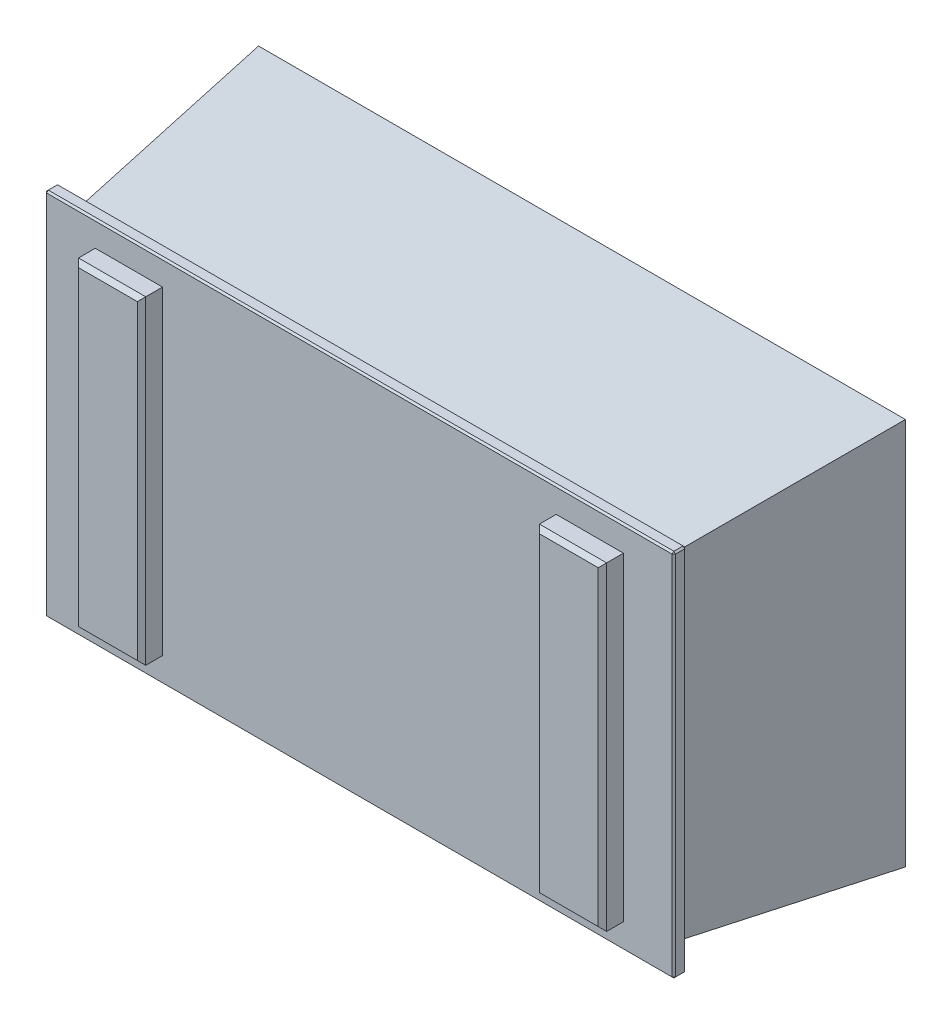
ISO-10303-21;
HEADER;
FILE_DESCRIPTION(('STEP AP214'),'2;1');
FILE_NAME('part.step','',(''),(''),'','','');
FILE_SCHEMA(('AUTOMOTIVE_DESIGN { 1 0 10303 214 1 1 1 1 }'));
ENDSEC;
DATA;
#1=APPLICATION_CONTEXT('core data for automotive mechanical design processes');
#2=APPLICATION_PROTOCOL_DEFINITION('international standard','automotive_design',2000,#1);
#3=PRODUCT_CONTEXT('',#1,'mechanical');
#4=PRODUCT('Part','Part','',(#3));
#5=PRODUCT_RELATED_PRODUCT_CATEGORY('part','',(#4));
#6=PRODUCT_DEFINITION_FORMATION('','',#4);
#7=PRODUCT_DEFINITION_CONTEXT('part definition',#1,'design');
#8=PRODUCT_DEFINITION('design','',#6,#7);
#9=PRODUCT_DEFINITION_SHAPE('','',#8);
#10=(LENGTH_UNIT() NAMED_UNIT(*) SI_UNIT(.MILLI.,.METRE.));
#11=(NAMED_UNIT(*) PLANE_ANGLE_UNIT() SI_UNIT($,.RADIAN.));
#12=(NAMED_UNIT(*) SI_UNIT($,.STERADIAN.) SOLID_ANGLE_UNIT());
#13=UNCERTAINTY_MEASURE_WITH_UNIT(LENGTH_MEASURE(1.E-05),#10,'distance_accuracy_value','');
#14=(GEOMETRIC_REPRESENTATION_CONTEXT(3) GLOBAL_UNCERTAINTY_ASSIGNED_CONTEXT((#13)) GLOBAL_UNIT_ASSIGNED_CONTEXT((#10,
#11,#12)) REPRESENTATION_CONTEXT('',''));
#15=CARTESIAN_POINT('',(0.,0.,0.));
#16=DIRECTION('',(0.,0.,1.));
#17=DIRECTION('',(1.,0.,0.));
#18=AXIS2_PLACEMENT_3D('',#15,#16,#17);
#19=CARTESIAN_POINT('',(-501.217589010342,-220.,-29.9001757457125));
#20=DIRECTION('',(0.,0.,1.));
#21=DIRECTION('',(1.,0.,0.));
#22=AXIS2_PLACEMENT_3D('',#19,#20,#21);
#23=PLANE('',#22);
#24=DIRECTION('',(0.,-1.,0.));
#25=VECTOR('',#24,1.);
#26=CARTESIAN_POINT('',(-499.217589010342,-220.,-29.9001757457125));
#27=LINE('',#26,#25);
#28=CARTESIAN_POINT('',(-499.217589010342,218.,-29.9001757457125));
#29=VERTEX_POINT('',#28);
#30=CARTESIAN_POINT('',(-499.217589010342,-218.,-29.9001757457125));
#31=VERTEX_POINT('',#30);
#32=EDGE_CURVE('E417',#29,#31,#27,.T.);
#33=ORIENTED_EDGE('',*,*,#32,.T.);
#34=DIRECTION('',(1.,0.,0.));
#35=VECTOR('',#34,1.);
#36=CARTESIAN_POINT('',(247.518820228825,-218.,-29.9001757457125));
#37=LINE('',#36,#35);
#38=CARTESIAN_POINT('',(245.518820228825,-218.,-29.9001757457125));
#39=VERTEX_POINT('',#38);
#40=EDGE_CURVE('E422',#31,#39,#37,.T.);
#41=ORIENTED_EDGE('',*,*,#40,.T.);
#42=DIRECTION('',(0.,1.,0.));
#43=VECTOR('',#42,1.);
#44=CARTESIAN_POINT('',(245.518820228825,220.,-29.9001757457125));
#45=LINE('',#44,#43);
#46=CARTESIAN_POINT('',(245.518820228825,218.,-29.9001757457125));
#47=VERTEX_POINT('',#46);
#48=EDGE_CURVE('E419',#39,#47,#45,.T.);
#49=ORIENTED_EDGE('',*,*,#48,.T.);
#50=DIRECTION('',(-1.,0.,0.));
#51=VECTOR('',#50,1.);
#52=CARTESIAN_POINT('',(-501.217589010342,218.,-29.9001757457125));
#53=LINE('',#52,#51);
#54=EDGE_CURVE('E396',#47,#29,#53,.T.);
#55=ORIENTED_EDGE('',*,*,#54,.T.);
#56=EDGE_LOOP('',(#33,#41,#49,#55));
#57=FACE_BOUND('',#56,.T.);
#58=DIRECTION('',(-1.,0.,0.));
#59=VECTOR('',#58,1.);
#60=CARTESIAN_POINT('',(187.518820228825,190.,-29.9001757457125));
#61=LINE('',#60,#59);
#62=CARTESIAN_POINT('',(187.518820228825,190.,-29.9001757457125));
#63=VERTEX_POINT('',#62);
#64=CARTESIAN_POINT('',(107.518820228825,190.,-29.9001757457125));
#65=VERTEX_POINT('',#64);
#66=EDGE_CURVE('E279',#63,#65,#61,.T.);
#67=ORIENTED_EDGE('',*,*,#66,.F.);
#68=DIRECTION('',(0.,1.,0.));
#69=VECTOR('',#68,1.);
#70=CARTESIAN_POINT('',(187.518820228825,-190.,-29.9001757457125));
#71=LINE('',#70,#69);
#72=CARTESIAN_POINT('',(187.518820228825,-190.,-29.9001757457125));
#73=VERTEX_POINT('',#72);
#74=EDGE_CURVE('E253',#73,#63,#71,.T.);
#75=ORIENTED_EDGE('',*,*,#74,.F.);
#76=DIRECTION('',(1.,0.,0.));
#77=VECTOR('',#76,1.);
#78=CARTESIAN_POINT('',(187.518820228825,-190.,-29.9001757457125));
#79=LINE('',#78,#77);
#80=CARTESIAN_POINT('',(107.518820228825,-190.,-29.9001757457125));
#81=VERTEX_POINT('',#80);
#82=EDGE_CURVE('E285',#81,#73,#79,.T.);
#83=ORIENTED_EDGE('',*,*,#82,.F.);
#84=DIRECTION('',(0.,-1.,0.));
#85=VECTOR('',#84,1.);
#86=CARTESIAN_POINT('',(107.518820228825,-190.,-29.9001757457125));
#87=LINE('',#86,#85);
#88=EDGE_CURVE('E282',#65,#81,#87,.T.);
#89=ORIENTED_EDGE('',*,*,#88,.F.);
#90=EDGE_LOOP('',(#67,#75,#83,#89));
#91=FACE_BOUND('',#90,.T.);
#92=DIRECTION('',(-1.,0.,0.));
#93=VECTOR('',#92,1.);
#94=CARTESIAN_POINT('',(-361.217589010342,190.,-29.9001757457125));
#95=LINE('',#94,#93);
#96=CARTESIAN_POINT('',(-361.217589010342,190.,-29.9001757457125));
#97=VERTEX_POINT('',#96);
#98=CARTESIAN_POINT('',(-441.217589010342,190.,-29.9001757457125));
#99=VERTEX_POINT('',#98);
#100=EDGE_CURVE('E247',#97,#99,#95,.T.);
#101=ORIENTED_EDGE('',*,*,#100,.F.);
#102=DIRECTION('',(0.,1.,0.));
#103=VECTOR('',#102,1.);
#104=CARTESIAN_POINT('',(-361.217589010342,-190.,-29.9001757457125));
#105=LINE('',#104,#103);
#106=CARTESIAN_POINT('',(-361.217589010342,-190.,-29.9001757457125));
#107=VERTEX_POINT('',#106);
#108=EDGE_CURVE('E257',#107,#97,#105,.T.);
#109=ORIENTED_EDGE('',*,*,#108,.F.);
#110=DIRECTION('',(1.,0.,0.));
#111=VECTOR('',#110,1.);
#112=CARTESIAN_POINT('',(-361.217589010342,-190.,-29.9001757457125));
#113=LINE('',#112,#111);
#114=CARTESIAN_POINT('',(-441.217589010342,-190.,-29.9001757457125));
#115=VERTEX_POINT('',#114);
#116=EDGE_CURVE('E269',#115,#107,#113,.T.);
#117=ORIENTED_EDGE('',*,*,#116,.F.);
#118=DIRECTION('',(0.,-1.,0.));
#119=VECTOR('',#118,1.);
#120=CARTESIAN_POINT('',(-441.217589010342,-190.,-29.9001757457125));
#121=LINE('',#120,#119);
#122=EDGE_CURVE('E267',#99,#115,#121,.T.);
#123=ORIENTED_EDGE('',*,*,#122,.F.);
#124=EDGE_LOOP('',(#101,#109,#117,#123));
#125=FACE_BOUND('',#124,.T.);
#126=ADVANCED_FACE('F33',(#57,#91,#125),#23,.T.);
#127=CARTESIAN_POINT('',(-481.217589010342,-200.,-294.900175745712));
#128=DIRECTION('',(0.,0.,-1.));
#129=DIRECTION('',(-1.,0.,0.));
#130=AXIS2_PLACEMENT_3D('',#127,#128,#129);
#131=PLANE('',#130);
#132=DIRECTION('',(1.,0.,0.));
#133=VECTOR('',#132,1.);
#134=CARTESIAN_POINT('',(227.518820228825,-230.696140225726,-294.900175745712));
#135=LINE('',#134,#133);
#136=CARTESIAN_POINT('',(258.214960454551,-230.696140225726,-294.900175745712));
#137=VERTEX_POINT('',#136);
#138=CARTESIAN_POINT('',(-511.913729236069,-230.696140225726,-294.900175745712));
#139=VERTEX_POINT('',#138);
#140=EDGE_CURVE('E340',#137,#139,#135,.F.);
#141=ORIENTED_EDGE('',*,*,#140,.T.);
#142=DIRECTION('',(0.,-1.,0.));
#143=VECTOR('',#142,1.);
#144=CARTESIAN_POINT('',(-511.913729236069,-200.,-294.900175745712));
#145=LINE('',#144,#143);
#146=CARTESIAN_POINT('',(-511.913729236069,230.696140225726,-294.900175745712));
#147=VERTEX_POINT('',#146);
#148=EDGE_CURVE('E357',#139,#147,#145,.F.);
#149=ORIENTED_EDGE('',*,*,#148,.T.);
#150=DIRECTION('',(-1.,0.,0.));
#151=VECTOR('',#150,1.);
#152=CARTESIAN_POINT('',(-481.217589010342,230.696140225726,-294.900175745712));
#153=LINE('',#152,#151);
#154=CARTESIAN_POINT('',(258.214960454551,230.696140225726,-294.900175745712));
#155=VERTEX_POINT('',#154);
#156=EDGE_CURVE('E359',#147,#155,#153,.F.);
#157=ORIENTED_EDGE('',*,*,#156,.T.);
#158=DIRECTION('',(0.,1.,0.));
#159=VECTOR('',#158,1.);
#160=CARTESIAN_POINT('',(258.214960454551,200.,-294.900175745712));
#161=LINE('',#160,#159);
#162=EDGE_CURVE('E350',#155,#137,#161,.F.);
#163=ORIENTED_EDGE('',*,*,#162,.T.);
#164=EDGE_LOOP('',(#141,#149,#157,#163));
#165=FACE_BOUND('',#164,.T.);
#166=DIRECTION('',(-1.,0.,0.));
#167=VECTOR('',#166,1.);
#168=CARTESIAN_POINT('',(-461.217589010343,210.696140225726,-294.900175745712));
#169=LINE('',#168,#167);
#170=CARTESIAN_POINT('',(-491.913729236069,210.696140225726,-294.900175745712));
#171=VERTEX_POINT('',#170);
#172=CARTESIAN_POINT('',(238.21496045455,210.696140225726,-294.900175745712));
#173=VERTEX_POINT('',#172);
#174=EDGE_CURVE('E300',#171,#173,#169,.F.);
#175=ORIENTED_EDGE('',*,*,#174,.F.);
#176=DIRECTION('',(0.,-1.,0.));
#177=VECTOR('',#176,1.);
#178=CARTESIAN_POINT('',(-491.913729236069,-180.,-294.900175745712));
#179=LINE('',#178,#177);
#180=CARTESIAN_POINT('',(-491.913729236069,-210.696140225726,-294.900175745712));
#181=VERTEX_POINT('',#180);
#182=EDGE_CURVE('E303',#181,#171,#179,.F.);
#183=ORIENTED_EDGE('',*,*,#182,.F.);
#184=DIRECTION('',(1.,0.,0.));
#185=VECTOR('',#184,1.);
#186=CARTESIAN_POINT('',(207.518820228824,-210.696140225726,-294.900175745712));
#187=LINE('',#186,#185);
#188=CARTESIAN_POINT('',(238.21496045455,-210.696140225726,-294.900175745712));
#189=VERTEX_POINT('',#188);
#190=EDGE_CURVE('E306',#189,#181,#187,.F.);
#191=ORIENTED_EDGE('',*,*,#190,.F.);
#192=DIRECTION('',(0.,1.,0.));
#193=VECTOR('',#192,1.);
#194=CARTESIAN_POINT('',(238.21496045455,180.,-294.900175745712));
#195=LINE('',#194,#193);
#196=EDGE_CURVE('E297',#173,#189,#195,.F.);
#197=ORIENTED_EDGE('',*,*,#196,.F.);
#198=EDGE_LOOP('',(#175,#183,#191,#197));
#199=FACE_BOUND('',#198,.T.);
#200=ADVANCED_FACE('F622',(#165,#199),#131,.T.);
#201=CARTESIAN_POINT('',(-501.217589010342,-220.,-44.9001757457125));
#202=DIRECTION('',(0.,0.,1.));
#203=DIRECTION('',(1.,0.,0.));
#204=AXIS2_PLACEMENT_3D('',#201,#202,#203);
#205=PLANE('',#204);
#206=DIRECTION('',(1.,0.,0.));
#207=VECTOR('',#206,1.);
#208=CARTESIAN_POINT('',(-501.217589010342,218.,-44.9001757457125));
#209=LINE('',#208,#207);
#210=CARTESIAN_POINT('',(-499.217589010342,218.,-44.9001757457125));
#211=VERTEX_POINT('',#210);
#212=CARTESIAN_POINT('',(245.518820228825,218.,-44.9001757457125));
#213=VERTEX_POINT('',#212);
#214=EDGE_CURVE('E433',#211,#213,#209,.T.);
#215=ORIENTED_EDGE('',*,*,#214,.T.);
#216=DIRECTION('',(0.,-1.,0.));
#217=VECTOR('',#216,1.);
#218=CARTESIAN_POINT('',(245.518820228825,-220.,-44.9001757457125));
#219=LINE('',#218,#217);
#220=CARTESIAN_POINT('',(245.518820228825,-218.,-44.9001757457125));
#221=VERTEX_POINT('',#220);
#222=EDGE_CURVE('E439',#213,#221,#219,.T.);
#223=ORIENTED_EDGE('',*,*,#222,.T.);
#224=DIRECTION('',(-1.,0.,0.));
#225=VECTOR('',#224,1.);
#226=CARTESIAN_POINT('',(-501.217589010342,-218.,-44.9001757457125));
#227=LINE('',#226,#225);
#228=CARTESIAN_POINT('',(-499.217589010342,-218.,-44.9001757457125));
#229=VERTEX_POINT('',#228);
#230=EDGE_CURVE('E437',#221,#229,#227,.T.);
#231=ORIENTED_EDGE('',*,*,#230,.T.);
#232=DIRECTION('',(0.,1.,0.));
#233=VECTOR('',#232,1.);
#234=CARTESIAN_POINT('',(-499.217589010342,-220.,-44.9001757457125));
#235=LINE('',#234,#233);
#236=EDGE_CURVE('E435',#229,#211,#235,.T.);
#237=ORIENTED_EDGE('',*,*,#236,.T.);
#238=EDGE_LOOP('',(#215,#223,#231,#237));
#239=FACE_BOUND('',#238,.T.);
#240=DIRECTION('',(-1.,0.,0.));
#241=VECTOR('',#240,1.);
#242=CARTESIAN_POINT('',(227.518820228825,-200.,-44.9001757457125));
#243=LINE('',#242,#241);
#244=CARTESIAN_POINT('',(227.518820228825,-200.,-44.9001757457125));
#245=VERTEX_POINT('',#244);
#246=CARTESIAN_POINT('',(-481.217589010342,-200.,-44.9001757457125));
#247=VERTEX_POINT('',#246);
#248=EDGE_CURVE('E328',#245,#247,#243,.T.);
#249=ORIENTED_EDGE('',*,*,#248,.F.);
#250=DIRECTION('',(0.,-1.,0.));
#251=VECTOR('',#250,1.);
#252=CARTESIAN_POINT('',(227.518820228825,200.,-44.9001757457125));
#253=LINE('',#252,#251);
#254=CARTESIAN_POINT('',(227.518820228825,200.,-44.9001757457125));
#255=VERTEX_POINT('',#254);
#256=EDGE_CURVE('E337',#255,#245,#253,.T.);
#257=ORIENTED_EDGE('',*,*,#256,.F.);
#258=DIRECTION('',(1.,0.,0.));
#259=VECTOR('',#258,1.);
#260=CARTESIAN_POINT('',(-481.217589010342,200.,-44.9001757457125));
#261=LINE('',#260,#259);
#262=CARTESIAN_POINT('',(-481.217589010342,200.,-44.9001757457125));
#263=VERTEX_POINT('',#262);
#264=EDGE_CURVE('E334',#263,#255,#261,.T.);
#265=ORIENTED_EDGE('',*,*,#264,.F.);
#266=DIRECTION('',(0.,1.,0.));
#267=VECTOR('',#266,1.);
#268=CARTESIAN_POINT('',(-481.217589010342,-200.,-44.9001757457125));
#269=LINE('',#268,#267);
#270=EDGE_CURVE('E331',#247,#263,#269,.T.);
#271=ORIENTED_EDGE('',*,*,#270,.F.);
#272=EDGE_LOOP('',(#249,#257,#265,#271));
#273=FACE_BOUND('',#272,.T.);
#274=ADVANCED_FACE('F583',(#239,#273),#205,.F.);
#275=CARTESIAN_POINT('',(-501.217589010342,220.,-29.9001757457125));
#276=DIRECTION('',(1.,0.,0.));
#277=DIRECTION('',(0.,0.,-1.));
#278=AXIS2_PLACEMENT_3D('',#275,#276,#277);
#279=PLANE('',#278);
#280=DIRECTION('',(0.,0.,1.));
#281=VECTOR('',#280,1.);
#282=CARTESIAN_POINT('',(-501.217589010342,-218.,-29.9001757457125));
#283=LINE('',#282,#281);
#284=CARTESIAN_POINT('',(-501.217589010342,-218.,-42.9001757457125));
#285=VERTEX_POINT('',#284);
#286=CARTESIAN_POINT('',(-501.217589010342,-218.,-31.9001757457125));
#287=VERTEX_POINT('',#286);
#288=EDGE_CURVE('E446',#285,#287,#283,.T.);
#289=ORIENTED_EDGE('',*,*,#288,.T.);
#290=DIRECTION('',(0.,1.,0.));
#291=VECTOR('',#290,1.);
#292=CARTESIAN_POINT('',(-501.217589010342,220.,-31.9001757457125));
#293=LINE('',#292,#291);
#294=CARTESIAN_POINT('',(-501.217589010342,218.,-31.9001757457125));
#295=VERTEX_POINT('',#294);
#296=EDGE_CURVE('E448',#287,#295,#293,.T.);
#297=ORIENTED_EDGE('',*,*,#296,.T.);
#298=DIRECTION('',(0.,0.,-1.));
#299=VECTOR('',#298,1.);
#300=CARTESIAN_POINT('',(-501.217589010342,218.,-29.9001757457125));
#301=LINE('',#300,#299);
#302=CARTESIAN_POINT('',(-501.217589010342,218.,-42.9001757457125));
#303=VERTEX_POINT('',#302);
#304=EDGE_CURVE('E442',#295,#303,#301,.T.);
#305=ORIENTED_EDGE('',*,*,#304,.T.);
#306=DIRECTION('',(0.,-1.,0.));
#307=VECTOR('',#306,1.);
#308=CARTESIAN_POINT('',(-501.217589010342,220.,-42.9001757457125));
#309=LINE('',#308,#307);
#310=EDGE_CURVE('E444',#303,#285,#309,.T.);
#311=ORIENTED_EDGE('',*,*,#310,.T.);
#312=EDGE_LOOP('',(#289,#297,#305,#311));
#313=FACE_BOUND('',#312,.T.);
#314=ADVANCED_FACE('F574',(#313),#279,.F.);
#315=CARTESIAN_POINT('',(-501.217589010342,-220.,-29.9001757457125));
#316=DIRECTION('',(0.,1.,0.));
#317=DIRECTION('',(0.,0.,1.));
#318=AXIS2_PLACEMENT_3D('',#315,#316,#317);
#319=PLANE('',#318);
#320=DIRECTION('',(-1.,0.,0.));
#321=VECTOR('',#320,1.);
#322=CARTESIAN_POINT('',(-501.217589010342,-220.,-31.9001757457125));
#323=LINE('',#322,#321);
#324=CARTESIAN_POINT('',(245.518820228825,-220.,-31.9001757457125));
#325=VERTEX_POINT('',#324);
#326=CARTESIAN_POINT('',(-499.217589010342,-220.,-31.9001757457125));
#327=VERTEX_POINT('',#326);
#328=EDGE_CURVE('E455',#325,#327,#323,.T.);
#329=ORIENTED_EDGE('',*,*,#328,.T.);
#330=DIRECTION('',(0.,0.,-1.));
#331=VECTOR('',#330,1.);
#332=CARTESIAN_POINT('',(-499.217589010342,-220.,-29.9001757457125));
#333=LINE('',#332,#331);
#334=CARTESIAN_POINT('',(-499.217589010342,-220.,-42.9001757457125));
#335=VERTEX_POINT('',#334);
#336=EDGE_CURVE('E457',#327,#335,#333,.T.);
#337=ORIENTED_EDGE('',*,*,#336,.T.);
#338=DIRECTION('',(1.,0.,0.));
#339=VECTOR('',#338,1.);
#340=CARTESIAN_POINT('',(-501.217589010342,-220.,-42.9001757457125));
#341=LINE('',#340,#339);
#342=CARTESIAN_POINT('',(245.518820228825,-220.,-42.9001757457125));
#343=VERTEX_POINT('',#342);
#344=EDGE_CURVE('E451',#335,#343,#341,.T.);
#345=ORIENTED_EDGE('',*,*,#344,.T.);
#346=DIRECTION('',(0.,0.,1.));
#347=VECTOR('',#346,1.);
#348=CARTESIAN_POINT('',(245.518820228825,-220.,-29.9001757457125));
#349=LINE('',#348,#347);
#350=EDGE_CURVE('E453',#343,#325,#349,.T.);
#351=ORIENTED_EDGE('',*,*,#350,.T.);
#352=EDGE_LOOP('',(#329,#337,#345,#351));
#353=FACE_BOUND('',#352,.T.);
#354=ADVANCED_FACE('F546',(#353),#319,.F.);
#355=CARTESIAN_POINT('',(247.518820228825,220.,-29.9001757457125));
#356=DIRECTION('',(-1.,0.,0.));
#357=DIRECTION('',(0.,-1.,0.));
#358=AXIS2_PLACEMENT_3D('',#355,#356,#357);
#359=PLANE('',#358);
#360=DIRECTION('',(0.,-1.,0.));
#361=VECTOR('',#360,1.);
#362=CARTESIAN_POINT('',(247.518820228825,-220.,-31.9001757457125));
#363=LINE('',#362,#361);
#364=CARTESIAN_POINT('',(247.518820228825,218.,-31.9001757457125));
#365=VERTEX_POINT('',#364);
#366=CARTESIAN_POINT('',(247.518820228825,-218.,-31.9001757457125));
#367=VERTEX_POINT('',#366);
#368=EDGE_CURVE('E428',#365,#367,#363,.T.);
#369=ORIENTED_EDGE('',*,*,#368,.T.);
#370=DIRECTION('',(0.,0.,-1.));
#371=VECTOR('',#370,1.);
#372=CARTESIAN_POINT('',(247.518820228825,-218.,-29.9001757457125));
#373=LINE('',#372,#371);
#374=CARTESIAN_POINT('',(247.518820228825,-218.,-42.9001757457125));
#375=VERTEX_POINT('',#374);
#376=EDGE_CURVE('E431',#367,#375,#373,.T.);
#377=ORIENTED_EDGE('',*,*,#376,.T.);
#378=DIRECTION('',(0.,1.,0.));
#379=VECTOR('',#378,1.);
#380=CARTESIAN_POINT('',(247.518820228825,220.,-42.9001757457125));
#381=LINE('',#380,#379);
#382=CARTESIAN_POINT('',(247.518820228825,218.,-42.9001757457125));
#383=VERTEX_POINT('',#382);
#384=EDGE_CURVE('E426',#375,#383,#381,.T.);
#385=ORIENTED_EDGE('',*,*,#384,.T.);
#386=DIRECTION('',(0.,0.,1.));
#387=VECTOR('',#386,1.);
#388=CARTESIAN_POINT('',(247.518820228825,218.,-29.9001757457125));
#389=LINE('',#388,#387);
#390=EDGE_CURVE('E424',#383,#365,#389,.T.);
#391=ORIENTED_EDGE('',*,*,#390,.T.);
#392=EDGE_LOOP('',(#369,#377,#385,#391));
#393=FACE_BOUND('',#392,.T.);
#394=ADVANCED_FACE('F643',(#393),#359,.F.);
#395=CARTESIAN_POINT('',(-501.217589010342,220.,-29.9001757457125));
#396=DIRECTION('',(0.,-1.,0.));
#397=DIRECTION('',(0.,0.,-1.));
#398=AXIS2_PLACEMENT_3D('',#395,#396,#397);
#399=PLANE('',#398);
#400=DIRECTION('',(1.,0.,0.));
#401=VECTOR('',#400,1.);
#402=CARTESIAN_POINT('',(247.518820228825,220.,-31.9001757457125));
#403=LINE('',#402,#401);
#404=CARTESIAN_POINT('',(-499.217589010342,220.,-31.9001757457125));
#405=VERTEX_POINT('',#404);
#406=CARTESIAN_POINT('',(245.518820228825,220.,-31.9001757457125));
#407=VERTEX_POINT('',#406);
#408=EDGE_CURVE('E42',#405,#407,#403,.T.);
#409=ORIENTED_EDGE('',*,*,#408,.T.);
#410=DIRECTION('',(0.,0.,-1.));
#411=VECTOR('',#410,1.);
#412=CARTESIAN_POINT('',(245.518820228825,220.,-29.9001757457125));
#413=LINE('',#412,#411);
#414=CARTESIAN_POINT('',(245.518820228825,220.,-42.9001757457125));
#415=VERTEX_POINT('',#414);
#416=EDGE_CURVE('E11',#407,#415,#413,.T.);
#417=ORIENTED_EDGE('',*,*,#416,.T.);
#418=DIRECTION('',(-1.,0.,0.));
#419=VECTOR('',#418,1.);
#420=CARTESIAN_POINT('',(-501.217589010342,220.,-42.9001757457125));
#421=LINE('',#420,#419);
#422=CARTESIAN_POINT('',(-499.217589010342,220.,-42.9001757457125));
#423=VERTEX_POINT('',#422);
#424=EDGE_CURVE('E460',#415,#423,#421,.T.);
#425=ORIENTED_EDGE('',*,*,#424,.T.);
#426=DIRECTION('',(0.,0.,1.));
#427=VECTOR('',#426,1.);
#428=CARTESIAN_POINT('',(-499.217589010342,220.,-29.9001757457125));
#429=LINE('',#428,#427);
#430=EDGE_CURVE('E53',#423,#405,#429,.T.);
#431=ORIENTED_EDGE('',*,*,#430,.T.);
#432=EDGE_LOOP('',(#409,#417,#425,#431));
#433=FACE_BOUND('',#432,.T.);
#434=ADVANCED_FACE('F639',(#433),#399,.F.);
#435=CARTESIAN_POINT('',(227.518820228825,-200.,-44.9001757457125));
#436=DIRECTION('',(0.,-0.992546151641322,0.121869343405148));
#437=DIRECTION('',(0.,-0.121869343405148,-0.992546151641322));
#438=AXIS2_PLACEMENT_3D('',#435,#436,#437);
#439=PLANE('',#438);
#440=ORIENTED_EDGE('',*,*,#248,.T.);
#441=DIRECTION('',(0.120974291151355,0.120974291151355,0.985256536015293));
#442=VECTOR('',#441,1.);
#443=CARTESIAN_POINT('',(-481.217589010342,-200.,-44.9001757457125));
#444=LINE('',#443,#442);
#445=EDGE_CURVE('E341',#139,#247,#444,.T.);
#446=ORIENTED_EDGE('',*,*,#445,.F.);
#447=ORIENTED_EDGE('',*,*,#140,.F.);
#448=DIRECTION('',(-0.120974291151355,0.120974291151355,0.985256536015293));
#449=VECTOR('',#448,1.);
#450=CARTESIAN_POINT('',(227.518820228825,-200.,-44.9001757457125));
#451=LINE('',#450,#449);
#452=EDGE_CURVE('E346',#137,#245,#451,.T.);
#453=ORIENTED_EDGE('',*,*,#452,.T.);
#454=EDGE_LOOP('',(#440,#446,#447,#453));
#455=FACE_BOUND('',#454,.T.);
#456=ADVANCED_FACE('F642',(#455),#439,.T.);
#457=CARTESIAN_POINT('',(-481.217589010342,-200.,-44.9001757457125));
#458=DIRECTION('',(-0.992546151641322,0.,0.121869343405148));
#459=DIRECTION('',(0.121869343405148,0.,0.992546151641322));
#460=AXIS2_PLACEMENT_3D('',#457,#458,#459);
#461=PLANE('',#460);
#462=ORIENTED_EDGE('',*,*,#270,.T.);
#463=DIRECTION('',(0.120974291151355,-0.120974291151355,0.985256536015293));
#464=VECTOR('',#463,1.);
#465=CARTESIAN_POINT('',(-481.217589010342,200.,-44.9001757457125));
#466=LINE('',#465,#464);
#467=EDGE_CURVE('E345',#147,#263,#466,.T.);
#468=ORIENTED_EDGE('',*,*,#467,.F.);
#469=ORIENTED_EDGE('',*,*,#148,.F.);
#470=ORIENTED_EDGE('',*,*,#445,.T.);
#471=EDGE_LOOP('',(#462,#468,#469,#470));
#472=FACE_BOUND('',#471,.T.);
#473=ADVANCED_FACE('F631',(#472),#461,.T.);
#474=CARTESIAN_POINT('',(-481.217589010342,200.,-44.9001757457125));
#475=DIRECTION('',(0.,0.992546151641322,0.121869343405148));
#476=DIRECTION('',(0.,-0.121869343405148,0.992546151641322));
#477=AXIS2_PLACEMENT_3D('',#474,#475,#476);
#478=PLANE('',#477);
#479=ORIENTED_EDGE('',*,*,#264,.T.);
#480=DIRECTION('',(-0.120974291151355,-0.120974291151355,0.985256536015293));
#481=VECTOR('',#480,1.);
#482=CARTESIAN_POINT('',(227.518820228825,200.,-44.9001757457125));
#483=LINE('',#482,#481);
#484=EDGE_CURVE('E349',#155,#255,#483,.T.);
#485=ORIENTED_EDGE('',*,*,#484,.F.);
#486=ORIENTED_EDGE('',*,*,#156,.F.);
#487=ORIENTED_EDGE('',*,*,#467,.T.);
#488=EDGE_LOOP('',(#479,#485,#486,#487));
#489=FACE_BOUND('',#488,.T.);
#490=ADVANCED_FACE('F1011',(#489),#478,.T.);
#491=CARTESIAN_POINT('',(227.518820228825,200.,-44.9001757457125));
#492=DIRECTION('',(0.992546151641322,0.,0.121869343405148));
#493=DIRECTION('',(0.121869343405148,0.,-0.992546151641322));
#494=AXIS2_PLACEMENT_3D('',#491,#492,#493);
#495=PLANE('',#494);
#496=ORIENTED_EDGE('',*,*,#256,.T.);
#497=ORIENTED_EDGE('',*,*,#452,.F.);
#498=ORIENTED_EDGE('',*,*,#162,.F.);
#499=ORIENTED_EDGE('',*,*,#484,.T.);
#500=EDGE_LOOP('',(#496,#497,#498,#499));
#501=FACE_BOUND('',#500,.T.);
#502=ADVANCED_FACE('F997',(#501),#495,.T.);
#503=CARTESIAN_POINT('',(-461.217589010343,-180.,-44.9001757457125));
#504=DIRECTION('',(-0.992546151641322,0.,0.121869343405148));
#505=DIRECTION('',(0.121869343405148,0.,0.992546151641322));
#506=AXIS2_PLACEMENT_3D('',#503,#504,#505);
#507=PLANE('',#506);
#508=ORIENTED_EDGE('',*,*,#182,.T.);
#509=DIRECTION('',(0.120974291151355,-0.120974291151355,0.985256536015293));
#510=VECTOR('',#509,1.);
#511=CARTESIAN_POINT('',(-461.217589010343,180.,-44.9001757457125));
#512=LINE('',#511,#510);
#513=CARTESIAN_POINT('',(-461.217589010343,180.,-44.9001757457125));
#514=VERTEX_POINT('',#513);
#515=EDGE_CURVE('E310',#171,#514,#512,.T.);
#516=ORIENTED_EDGE('',*,*,#515,.T.);
#517=DIRECTION('',(0.,1.,0.));
#518=VECTOR('',#517,1.);
#519=CARTESIAN_POINT('',(-461.217589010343,-180.,-44.9001757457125));
#520=LINE('',#519,#518);
#521=CARTESIAN_POINT('',(-461.217589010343,-180.,-44.9001757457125));
#522=VERTEX_POINT('',#521);
#523=EDGE_CURVE('E319',#522,#514,#520,.T.);
#524=ORIENTED_EDGE('',*,*,#523,.F.);
#525=DIRECTION('',(0.120974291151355,0.120974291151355,0.985256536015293));
#526=VECTOR('',#525,1.);
#527=CARTESIAN_POINT('',(-461.217589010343,-180.,-44.9001757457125));
#528=LINE('',#527,#526);
#529=EDGE_CURVE('E296',#181,#522,#528,.T.);
#530=ORIENTED_EDGE('',*,*,#529,.F.);
#531=EDGE_LOOP('',(#508,#516,#524,#530));
#532=FACE_BOUND('',#531,.T.);
#533=ADVANCED_FACE('F987',(#532),#507,.F.);
#534=CARTESIAN_POINT('',(-461.217589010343,180.,-44.9001757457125));
#535=DIRECTION('',(0.,0.992546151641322,0.121869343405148));
#536=DIRECTION('',(0.,-0.121869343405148,0.992546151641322));
#537=AXIS2_PLACEMENT_3D('',#534,#535,#536);
#538=PLANE('',#537);
#539=ORIENTED_EDGE('',*,*,#174,.T.);
#540=DIRECTION('',(-0.120974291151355,-0.120974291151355,0.985256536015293));
#541=VECTOR('',#540,1.);
#542=CARTESIAN_POINT('',(207.518820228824,180.,-44.9001757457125));
#543=LINE('',#542,#541);
#544=CARTESIAN_POINT('',(207.518820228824,180.,-44.9001757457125));
#545=VERTEX_POINT('',#544);
#546=EDGE_CURVE('E312',#173,#545,#543,.T.);
#547=ORIENTED_EDGE('',*,*,#546,.T.);
#548=DIRECTION('',(1.,0.,0.));
#549=VECTOR('',#548,1.);
#550=CARTESIAN_POINT('',(-461.217589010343,180.,-44.9001757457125));
#551=LINE('',#550,#549);
#552=EDGE_CURVE('E322',#514,#545,#551,.T.);
#553=ORIENTED_EDGE('',*,*,#552,.F.);
#554=ORIENTED_EDGE('',*,*,#515,.F.);
#555=EDGE_LOOP('',(#539,#547,#553,#554));
#556=FACE_BOUND('',#555,.T.);
#557=ADVANCED_FACE('F978',(#556),#538,.F.);
#558=CARTESIAN_POINT('',(207.518820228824,180.,-44.9001757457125));
#559=DIRECTION('',(0.992546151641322,0.,0.121869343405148));
#560=DIRECTION('',(0.121869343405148,0.,-0.992546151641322));
#561=AXIS2_PLACEMENT_3D('',#558,#559,#560);
#562=PLANE('',#561);
#563=ORIENTED_EDGE('',*,*,#196,.T.);
#564=DIRECTION('',(-0.120974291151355,0.120974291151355,0.985256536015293));
#565=VECTOR('',#564,1.);
#566=CARTESIAN_POINT('',(207.518820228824,-180.,-44.9001757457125));
#567=LINE('',#566,#565);
#568=CARTESIAN_POINT('',(207.518820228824,-180.,-44.9001757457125));
#569=VERTEX_POINT('',#568);
#570=EDGE_CURVE('E309',#189,#569,#567,.T.);
#571=ORIENTED_EDGE('',*,*,#570,.T.);
#572=DIRECTION('',(0.,-1.,0.));
#573=VECTOR('',#572,1.);
#574=CARTESIAN_POINT('',(207.518820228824,180.,-44.9001757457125));
#575=LINE('',#574,#573);
#576=EDGE_CURVE('E325',#545,#569,#575,.T.);
#577=ORIENTED_EDGE('',*,*,#576,.F.);
#578=ORIENTED_EDGE('',*,*,#546,.F.);
#579=EDGE_LOOP('',(#563,#571,#577,#578));
#580=FACE_BOUND('',#579,.T.);
#581=ADVANCED_FACE('F969',(#580),#562,.F.);
#582=CARTESIAN_POINT('',(207.518820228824,-180.,-44.9001757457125));
#583=DIRECTION('',(0.,-0.992546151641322,0.121869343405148));
#584=DIRECTION('',(0.,-0.121869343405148,-0.992546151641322));
#585=AXIS2_PLACEMENT_3D('',#582,#583,#584);
#586=PLANE('',#585);
#587=ORIENTED_EDGE('',*,*,#190,.T.);
#588=ORIENTED_EDGE('',*,*,#529,.T.);
#589=DIRECTION('',(-1.,0.,0.));
#590=VECTOR('',#589,1.);
#591=CARTESIAN_POINT('',(207.518820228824,-180.,-44.9001757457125));
#592=LINE('',#591,#590);
#593=EDGE_CURVE('E299',#569,#522,#592,.T.);
#594=ORIENTED_EDGE('',*,*,#593,.F.);
#595=ORIENTED_EDGE('',*,*,#570,.F.);
#596=EDGE_LOOP('',(#587,#588,#594,#595));
#597=FACE_BOUND('',#596,.T.);
#598=ADVANCED_FACE('F637',(#597),#586,.F.);
#599=ORIENTED_EDGE('',*,*,#576,.T.);
#600=ORIENTED_EDGE('',*,*,#593,.T.);
#601=ORIENTED_EDGE('',*,*,#523,.T.);
#602=ORIENTED_EDGE('',*,*,#552,.T.);
#603=EDGE_LOOP('',(#599,#600,#601,#602));
#604=FACE_BOUND('',#603,.T.);
#605=ADVANCED_FACE('F633',(#604),#205,.F.);
#606=CARTESIAN_POINT('',(187.518820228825,-190.,-4.90017574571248));
#607=DIRECTION('',(-1.,0.,0.));
#608=DIRECTION('',(0.,0.,1.));
#609=AXIS2_PLACEMENT_3D('',#606,#607,#608);
#610=PLANE('',#609);
#611=DIRECTION('',(0.,0.,-1.));
#612=VECTOR('',#611,1.);
#613=CARTESIAN_POINT('',(187.518820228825,190.,-4.90017574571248));
#614=LINE('',#613,#612);
#615=CARTESIAN_POINT('',(187.518820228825,190.,-9.90017574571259));
#616=VERTEX_POINT('',#615);
#617=EDGE_CURVE('E294',#616,#63,#614,.T.);
#618=ORIENTED_EDGE('',*,*,#617,.F.);
#619=DIRECTION('',(0.,-1.,0.));
#620=VECTOR('',#619,1.);
#621=CARTESIAN_POINT('',(187.518820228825,-190.,-9.90017574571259));
#622=LINE('',#621,#620);
#623=CARTESIAN_POINT('',(187.518820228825,-190.,-9.90017574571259));
#624=VERTEX_POINT('',#623);
#625=EDGE_CURVE('E394',#616,#624,#622,.T.);
#626=ORIENTED_EDGE('',*,*,#625,.T.);
#627=DIRECTION('',(0.,0.,-1.));
#628=VECTOR('',#627,1.);
#629=CARTESIAN_POINT('',(187.518820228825,-190.,-4.90017574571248));
#630=LINE('',#629,#628);
#631=EDGE_CURVE('E288',#624,#73,#630,.T.);
#632=ORIENTED_EDGE('',*,*,#631,.T.);
#633=ORIENTED_EDGE('',*,*,#74,.T.);
#634=EDGE_LOOP('',(#618,#626,#632,#633));
#635=FACE_BOUND('',#634,.T.);
#636=ADVANCED_FACE('F636',(#635),#610,.F.);
#637=CARTESIAN_POINT('',(187.518820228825,190.,-4.90017574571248));
#638=DIRECTION('',(0.,-1.,0.));
#639=DIRECTION('',(0.,0.,-1.));
#640=AXIS2_PLACEMENT_3D('',#637,#638,#639);
#641=PLANE('',#640);
#642=DIRECTION('',(0.,0.,-1.));
#643=VECTOR('',#642,1.);
#644=CARTESIAN_POINT('',(107.518820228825,190.,-4.90017574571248));
#645=LINE('',#644,#643);
#646=CARTESIAN_POINT('',(107.518820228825,190.,-9.90017574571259));
#647=VERTEX_POINT('',#646);
#648=EDGE_CURVE('E292',#647,#65,#645,.T.);
#649=ORIENTED_EDGE('',*,*,#648,.F.);
#650=DIRECTION('',(1.,0.,0.));
#651=VECTOR('',#650,1.);
#652=CARTESIAN_POINT('',(187.518820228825,190.,-9.90017574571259));
#653=LINE('',#652,#651);
#654=EDGE_CURVE('E392',#647,#616,#653,.T.);
#655=ORIENTED_EDGE('',*,*,#654,.T.);
#656=ORIENTED_EDGE('',*,*,#617,.T.);
#657=ORIENTED_EDGE('',*,*,#66,.T.);
#658=EDGE_LOOP('',(#649,#655,#656,#657));
#659=FACE_BOUND('',#658,.T.);
#660=ADVANCED_FACE('F938',(#659),#641,.F.);
#661=CARTESIAN_POINT('',(107.518820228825,-190.,-4.90017574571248));
#662=DIRECTION('',(1.,0.,0.));
#663=DIRECTION('',(0.,0.,-1.));
#664=AXIS2_PLACEMENT_3D('',#661,#662,#663);
#665=PLANE('',#664);
#666=DIRECTION('',(0.,0.,-1.));
#667=VECTOR('',#666,1.);
#668=CARTESIAN_POINT('',(107.518820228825,-190.,-4.90017574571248));
#669=LINE('',#668,#667);
#670=CARTESIAN_POINT('',(107.518820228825,-190.,-9.90017574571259));
#671=VERTEX_POINT('',#670);
#672=EDGE_CURVE('E290',#671,#81,#669,.T.);
#673=ORIENTED_EDGE('',*,*,#672,.F.);
#674=DIRECTION('',(0.,1.,0.));
#675=VECTOR('',#674,1.);
#676=CARTESIAN_POINT('',(107.518820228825,190.,-9.90017574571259));
#677=LINE('',#676,#675);
#678=EDGE_CURVE('E390',#671,#647,#677,.T.);
#679=ORIENTED_EDGE('',*,*,#678,.T.);
#680=ORIENTED_EDGE('',*,*,#648,.T.);
#681=ORIENTED_EDGE('',*,*,#88,.T.);
#682=EDGE_LOOP('',(#673,#679,#680,#681));
#683=FACE_BOUND('',#682,.T.);
#684=ADVANCED_FACE('F929',(#683),#665,.F.);
#685=CARTESIAN_POINT('',(187.518820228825,-190.,-4.90017574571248));
#686=DIRECTION('',(0.,1.,0.));
#687=DIRECTION('',(0.,0.,1.));
#688=AXIS2_PLACEMENT_3D('',#685,#686,#687);
#689=PLANE('',#688);
#690=ORIENTED_EDGE('',*,*,#631,.F.);
#691=DIRECTION('',(-1.,0.,0.));
#692=VECTOR('',#691,1.);
#693=CARTESIAN_POINT('',(107.518820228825,-190.,-9.90017574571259));
#694=LINE('',#693,#692);
#695=EDGE_CURVE('E387',#624,#671,#694,.T.);
#696=ORIENTED_EDGE('',*,*,#695,.T.);
#697=ORIENTED_EDGE('',*,*,#672,.T.);
#698=ORIENTED_EDGE('',*,*,#82,.T.);
#699=EDGE_LOOP('',(#690,#696,#697,#698));
#700=FACE_BOUND('',#699,.T.);
#701=ADVANCED_FACE('F920',(#700),#689,.F.);
#702=CARTESIAN_POINT('',(187.518820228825,190.,-4.90017574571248));
#703=DIRECTION('',(0.,0.,1.));
#704=DIRECTION('',(1.,0.,0.));
#705=AXIS2_PLACEMENT_3D('',#702,#703,#704);
#706=PLANE('',#705);
#707=DIRECTION('',(0.,-1.,0.));
#708=VECTOR('',#707,1.);
#709=CARTESIAN_POINT('',(112.518820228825,-190.,-4.90017574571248));
#710=LINE('',#709,#708);
#711=CARTESIAN_POINT('',(112.518820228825,185.,-4.90017574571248));
#712=VERTEX_POINT('',#711);
#713=CARTESIAN_POINT('',(112.518820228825,-185.,-4.90017574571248));
#714=VERTEX_POINT('',#713);
#715=EDGE_CURVE('E382',#712,#714,#710,.T.);
#716=ORIENTED_EDGE('',*,*,#715,.T.);
#717=DIRECTION('',(1.,0.,0.));
#718=VECTOR('',#717,1.);
#719=CARTESIAN_POINT('',(187.518820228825,-185.,-4.90017574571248));
#720=LINE('',#719,#718);
#721=CARTESIAN_POINT('',(182.518820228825,-185.,-4.90017574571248));
#722=VERTEX_POINT('',#721);
#723=EDGE_CURVE('E384',#714,#722,#720,.T.);
#724=ORIENTED_EDGE('',*,*,#723,.T.);
#725=DIRECTION('',(0.,1.,0.));
#726=VECTOR('',#725,1.);
#727=CARTESIAN_POINT('',(182.518820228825,190.,-4.90017574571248));
#728=LINE('',#727,#726);
#729=CARTESIAN_POINT('',(182.518820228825,185.,-4.90017574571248));
#730=VERTEX_POINT('',#729);
#731=EDGE_CURVE('E378',#722,#730,#728,.T.);
#732=ORIENTED_EDGE('',*,*,#731,.T.);
#733=DIRECTION('',(-1.,0.,0.));
#734=VECTOR('',#733,1.);
#735=CARTESIAN_POINT('',(107.518820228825,185.,-4.90017574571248));
#736=LINE('',#735,#734);
#737=EDGE_CURVE('E380',#730,#712,#736,.T.);
#738=ORIENTED_EDGE('',*,*,#737,.T.);
#739=EDGE_LOOP('',(#716,#724,#732,#738));
#740=FACE_BOUND('',#739,.T.);
#741=ADVANCED_FACE('F912',(#740),#706,.T.);
#742=CARTESIAN_POINT('',(-361.217589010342,-190.,-4.90017574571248));
#743=DIRECTION('',(-1.,0.,0.));
#744=DIRECTION('',(0.,0.,1.));
#745=AXIS2_PLACEMENT_3D('',#742,#743,#744);
#746=PLANE('',#745);
#747=DIRECTION('',(0.,0.,-1.));
#748=VECTOR('',#747,1.);
#749=CARTESIAN_POINT('',(-361.217589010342,190.,-4.90017574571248));
#750=LINE('',#749,#748);
#751=CARTESIAN_POINT('',(-361.217589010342,190.,-9.90017574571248));
#752=VERTEX_POINT('',#751);
#753=EDGE_CURVE('E242',#752,#97,#750,.T.);
#754=ORIENTED_EDGE('',*,*,#753,.F.);
#755=DIRECTION('',(0.,-1.,0.));
#756=VECTOR('',#755,1.);
#757=CARTESIAN_POINT('',(-361.217589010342,-190.,-9.90017574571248));
#758=LINE('',#757,#756);
#759=CARTESIAN_POINT('',(-361.217589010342,-190.,-9.90017574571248));
#760=VERTEX_POINT('',#759);
#761=EDGE_CURVE('E376',#752,#760,#758,.T.);
#762=ORIENTED_EDGE('',*,*,#761,.T.);
#763=DIRECTION('',(0.,0.,-1.));
#764=VECTOR('',#763,1.);
#765=CARTESIAN_POINT('',(-361.217589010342,-190.,-4.90017574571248));
#766=LINE('',#765,#764);
#767=EDGE_CURVE('E260',#760,#107,#766,.T.);
#768=ORIENTED_EDGE('',*,*,#767,.T.);
#769=ORIENTED_EDGE('',*,*,#108,.T.);
#770=EDGE_LOOP('',(#754,#762,#768,#769));
#771=FACE_BOUND('',#770,.T.);
#772=ADVANCED_FACE('F258',(#771),#746,.F.);
#773=CARTESIAN_POINT('',(-361.217589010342,190.,-4.90017574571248));
#774=DIRECTION('',(0.,-1.,0.));
#775=DIRECTION('',(1.,0.,0.));
#776=AXIS2_PLACEMENT_3D('',#773,#774,#775);
#777=PLANE('',#776);
#778=DIRECTION('',(0.,0.,-1.));
#779=VECTOR('',#778,1.);
#780=CARTESIAN_POINT('',(-441.217589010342,190.,-4.90017574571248));
#781=LINE('',#780,#779);
#782=CARTESIAN_POINT('',(-441.217589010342,190.,-9.90017574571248));
#783=VERTEX_POINT('',#782);
#784=EDGE_CURVE('E254',#783,#99,#781,.T.);
#785=ORIENTED_EDGE('',*,*,#784,.F.);
#786=DIRECTION('',(1.,0.,0.));
#787=VECTOR('',#786,1.);
#788=CARTESIAN_POINT('',(-361.217589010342,190.,-9.90017574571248));
#789=LINE('',#788,#787);
#790=EDGE_CURVE('E250',#783,#752,#789,.T.);
#791=ORIENTED_EDGE('',*,*,#790,.T.);
#792=ORIENTED_EDGE('',*,*,#753,.T.);
#793=ORIENTED_EDGE('',*,*,#100,.T.);
#794=EDGE_LOOP('',(#785,#791,#792,#793));
#795=FACE_BOUND('',#794,.T.);
#796=ADVANCED_FACE('F245',(#795),#777,.F.);
#797=CARTESIAN_POINT('',(-441.217589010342,-190.,-4.90017574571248));
#798=DIRECTION('',(1.,0.,0.));
#799=DIRECTION('',(0.,0.,-1.));
#800=AXIS2_PLACEMENT_3D('',#797,#798,#799);
#801=PLANE('',#800);
#802=DIRECTION('',(0.,0.,-1.));
#803=VECTOR('',#802,1.);
#804=CARTESIAN_POINT('',(-441.217589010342,-190.,-4.90017574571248));
#805=LINE('',#804,#803);
#806=CARTESIAN_POINT('',(-441.217589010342,-190.,-9.90017574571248));
#807=VERTEX_POINT('',#806);
#808=EDGE_CURVE('E274',#807,#115,#805,.T.);
#809=ORIENTED_EDGE('',*,*,#808,.F.);
#810=DIRECTION('',(0.,1.,0.));
#811=VECTOR('',#810,1.);
#812=CARTESIAN_POINT('',(-441.217589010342,190.,-9.90017574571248));
#813=LINE('',#812,#811);
#814=EDGE_CURVE('E373',#807,#783,#813,.T.);
#815=ORIENTED_EDGE('',*,*,#814,.T.);
#816=ORIENTED_EDGE('',*,*,#784,.T.);
#817=ORIENTED_EDGE('',*,*,#122,.T.);
#818=EDGE_LOOP('',(#809,#815,#816,#817));
#819=FACE_BOUND('',#818,.T.);
#820=ADVANCED_FACE('F888',(#819),#801,.F.);
#821=CARTESIAN_POINT('',(-361.217589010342,-190.,-4.90017574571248));
#822=DIRECTION('',(0.,1.,0.));
#823=DIRECTION('',(-1.,0.,0.));
#824=AXIS2_PLACEMENT_3D('',#821,#822,#823);
#825=PLANE('',#824);
#826=ORIENTED_EDGE('',*,*,#767,.F.);
#827=DIRECTION('',(-1.,0.,0.));
#828=VECTOR('',#827,1.);
#829=CARTESIAN_POINT('',(-441.217589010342,-190.,-9.90017574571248));
#830=LINE('',#829,#828);
#831=EDGE_CURVE('E370',#760,#807,#830,.T.);
#832=ORIENTED_EDGE('',*,*,#831,.T.);
#833=ORIENTED_EDGE('',*,*,#808,.T.);
#834=ORIENTED_EDGE('',*,*,#116,.T.);
#835=EDGE_LOOP('',(#826,#832,#833,#834));
#836=FACE_BOUND('',#835,.T.);
#837=ADVANCED_FACE('F879',(#836),#825,.F.);
#838=CARTESIAN_POINT('',(-361.217589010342,190.,-4.90017574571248));
#839=DIRECTION('',(0.,0.,1.));
#840=DIRECTION('',(1.,0.,0.));
#841=AXIS2_PLACEMENT_3D('',#838,#839,#840);
#842=PLANE('',#841);
#843=DIRECTION('',(0.,-1.,0.));
#844=VECTOR('',#843,1.);
#845=CARTESIAN_POINT('',(-436.217589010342,-190.,-4.90017574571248));
#846=LINE('',#845,#844);
#847=CARTESIAN_POINT('',(-436.217589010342,185.,-4.90017574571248));
#848=VERTEX_POINT('',#847);
#849=CARTESIAN_POINT('',(-436.217589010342,-185.,-4.90017574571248));
#850=VERTEX_POINT('',#849);
#851=EDGE_CURVE('E365',#848,#850,#846,.T.);
#852=ORIENTED_EDGE('',*,*,#851,.T.);
#853=DIRECTION('',(1.,0.,0.));
#854=VECTOR('',#853,1.);
#855=CARTESIAN_POINT('',(-361.217589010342,-185.,-4.90017574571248));
#856=LINE('',#855,#854);
#857=CARTESIAN_POINT('',(-366.217589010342,-185.,-4.90017574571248));
#858=VERTEX_POINT('',#857);
#859=EDGE_CURVE('E367',#850,#858,#856,.T.);
#860=ORIENTED_EDGE('',*,*,#859,.T.);
#861=DIRECTION('',(0.,1.,0.));
#862=VECTOR('',#861,1.);
#863=CARTESIAN_POINT('',(-366.217589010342,190.,-4.90017574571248));
#864=LINE('',#863,#862);
#865=CARTESIAN_POINT('',(-366.217589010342,185.,-4.90017574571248));
#866=VERTEX_POINT('',#865);
#867=EDGE_CURVE('E344',#858,#866,#864,.T.);
#868=ORIENTED_EDGE('',*,*,#867,.T.);
#869=DIRECTION('',(-1.,0.,0.));
#870=VECTOR('',#869,1.);
#871=CARTESIAN_POINT('',(-441.217589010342,185.,-4.90017574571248));
#872=LINE('',#871,#870);
#873=EDGE_CURVE('E363',#866,#848,#872,.T.);
#874=ORIENTED_EDGE('',*,*,#873,.T.);
#875=EDGE_LOOP('',(#852,#860,#868,#874));
#876=FACE_BOUND('',#875,.T.);
#877=ADVANCED_FACE('F667',(#876),#842,.T.);
#878=CARTESIAN_POINT('',(-361.217589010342,185.,-4.90017574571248));
#879=DIRECTION('',(0.,0.707106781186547,0.707106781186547));
#880=DIRECTION('',(0.,-0.707106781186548,0.707106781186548));
#881=AXIS2_PLACEMENT_3D('',#878,#879,#880);
#882=PLANE('',#881);
#883=DIRECTION('',(-0.577350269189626,-0.577350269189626,0.577350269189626));
#884=VECTOR('',#883,1.);
#885=CARTESIAN_POINT('',(-364.550922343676,186.666666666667,-6.56684241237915));
#886=LINE('',#885,#884);
#887=EDGE_CURVE('E402',#752,#866,#886,.T.);
#888=ORIENTED_EDGE('',*,*,#887,.F.);
#889=ORIENTED_EDGE('',*,*,#790,.F.);
#890=DIRECTION('',(0.577350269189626,-0.577350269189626,0.577350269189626));
#891=VECTOR('',#890,1.);
#892=CARTESIAN_POINT('',(-411.217589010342,160.,20.0998242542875));
#893=LINE('',#892,#891);
#894=EDGE_CURVE('E264',#848,#783,#893,.F.);
#895=ORIENTED_EDGE('',*,*,#894,.F.);
#896=ORIENTED_EDGE('',*,*,#873,.F.);
#897=EDGE_LOOP('',(#888,#889,#895,#896));
#898=FACE_BOUND('',#897,.T.);
#899=ADVANCED_FACE('F663',(#898),#882,.T.);
#900=CARTESIAN_POINT('',(-436.217589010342,190.,-4.90017574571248));
#901=DIRECTION('',(-0.707106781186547,0.,0.707106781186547));
#902=DIRECTION('',(0.707106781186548,0.,0.707106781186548));
#903=AXIS2_PLACEMENT_3D('',#900,#901,#902);
#904=PLANE('',#903);
#905=ORIENTED_EDGE('',*,*,#894,.T.);
#906=ORIENTED_EDGE('',*,*,#814,.F.);
#907=DIRECTION('',(0.577350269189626,0.577350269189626,0.577350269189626));
#908=VECTOR('',#907,1.);
#909=CARTESIAN_POINT('',(-311.217589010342,-60.,120.099824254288));
#910=LINE('',#909,#908);
#911=EDGE_CURVE('E399',#850,#807,#910,.F.);
#912=ORIENTED_EDGE('',*,*,#911,.F.);
#913=ORIENTED_EDGE('',*,*,#851,.F.);
#914=EDGE_LOOP('',(#905,#906,#912,#913));
#915=FACE_BOUND('',#914,.T.);
#916=ADVANCED_FACE('F659',(#915),#904,.T.);
#917=CARTESIAN_POINT('',(-366.217589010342,190.,-4.90017574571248));
#918=DIRECTION('',(0.707106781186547,0.,0.707106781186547));
#919=DIRECTION('',(0.707106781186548,0.,-0.707106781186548));
#920=AXIS2_PLACEMENT_3D('',#917,#918,#919);
#921=PLANE('',#920);
#922=ORIENTED_EDGE('',*,*,#887,.T.);
#923=ORIENTED_EDGE('',*,*,#867,.F.);
#924=DIRECTION('',(0.577350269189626,-0.577350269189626,-0.577350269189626));
#925=VECTOR('',#924,1.);
#926=CARTESIAN_POINT('',(-491.217589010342,-60.0000000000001,120.099824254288));
#927=LINE('',#926,#925);
#928=EDGE_CURVE('E397',#760,#858,#927,.F.);
#929=ORIENTED_EDGE('',*,*,#928,.F.);
#930=ORIENTED_EDGE('',*,*,#761,.F.);
#931=EDGE_LOOP('',(#922,#923,#929,#930));
#932=FACE_BOUND('',#931,.T.);
#933=ADVANCED_FACE('F655',(#932),#921,.T.);
#934=CARTESIAN_POINT('',(-361.217589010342,-185.,-4.90017574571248));
#935=DIRECTION('',(0.,-0.707106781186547,0.707106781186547));
#936=DIRECTION('',(0.,-0.707106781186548,-0.707106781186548));
#937=AXIS2_PLACEMENT_3D('',#934,#935,#936);
#938=PLANE('',#937);
#939=ORIENTED_EDGE('',*,*,#911,.T.);
#940=ORIENTED_EDGE('',*,*,#831,.F.);
#941=ORIENTED_EDGE('',*,*,#928,.T.);
#942=ORIENTED_EDGE('',*,*,#859,.F.);
#943=EDGE_LOOP('',(#939,#940,#941,#942));
#944=FACE_BOUND('',#943,.T.);
#945=ADVANCED_FACE('F651',(#944),#938,.T.);
#946=CARTESIAN_POINT('',(187.518820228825,185.,-4.90017574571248));
#947=DIRECTION('',(0.,0.707106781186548,0.707106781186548));
#948=DIRECTION('',(0.,-0.707106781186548,0.707106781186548));
#949=AXIS2_PLACEMENT_3D('',#946,#947,#948);
#950=PLANE('',#949);
#951=DIRECTION('',(-0.577350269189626,-0.577350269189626,0.577350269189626));
#952=VECTOR('',#951,1.);
#953=CARTESIAN_POINT('',(184.185486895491,186.666666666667,-6.56684241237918));
#954=LINE('',#953,#952);
#955=EDGE_CURVE('E411',#616,#730,#954,.T.);
#956=ORIENTED_EDGE('',*,*,#955,.F.);
#957=ORIENTED_EDGE('',*,*,#654,.F.);
#958=DIRECTION('',(0.577350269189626,-0.577350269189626,0.577350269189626));
#959=VECTOR('',#958,1.);
#960=CARTESIAN_POINT('',(137.518820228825,160.,20.0998242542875));
#961=LINE('',#960,#959);
#962=EDGE_CURVE('E400',#712,#647,#961,.F.);
#963=ORIENTED_EDGE('',*,*,#962,.F.);
#964=ORIENTED_EDGE('',*,*,#737,.F.);
#965=EDGE_LOOP('',(#956,#957,#963,#964));
#966=FACE_BOUND('',#965,.T.);
#967=ADVANCED_FACE('F654',(#966),#950,.T.);
#968=CARTESIAN_POINT('',(112.518820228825,190.,-4.90017574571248));
#969=DIRECTION('',(-0.707106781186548,0.,0.707106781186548));
#970=DIRECTION('',(0.707106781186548,0.,0.707106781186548));
#971=AXIS2_PLACEMENT_3D('',#968,#969,#970);
#972=PLANE('',#971);
#973=ORIENTED_EDGE('',*,*,#962,.T.);
#974=ORIENTED_EDGE('',*,*,#678,.F.);
#975=DIRECTION('',(0.577350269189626,0.577350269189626,0.577350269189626));
#976=VECTOR('',#975,1.);
#977=CARTESIAN_POINT('',(237.518820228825,-59.9999999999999,120.099824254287));
#978=LINE('',#977,#976);
#979=EDGE_CURVE('E409',#714,#671,#978,.F.);
#980=ORIENTED_EDGE('',*,*,#979,.F.);
#981=ORIENTED_EDGE('',*,*,#715,.F.);
#982=EDGE_LOOP('',(#973,#974,#980,#981));
#983=FACE_BOUND('',#982,.T.);
#984=ADVANCED_FACE('F676',(#983),#972,.T.);
#985=CARTESIAN_POINT('',(182.518820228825,190.,-4.90017574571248));
#986=DIRECTION('',(0.707106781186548,0.,0.707106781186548));
#987=DIRECTION('',(0.707106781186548,0.,-0.707106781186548));
#988=AXIS2_PLACEMENT_3D('',#985,#986,#987);
#989=PLANE('',#988);
#990=ORIENTED_EDGE('',*,*,#955,.T.);
#991=ORIENTED_EDGE('',*,*,#731,.F.);
#992=DIRECTION('',(0.577350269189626,-0.577350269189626,-0.577350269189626));
#993=VECTOR('',#992,1.);
#994=CARTESIAN_POINT('',(57.5188202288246,-59.9999999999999,120.099824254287));
#995=LINE('',#994,#993);
#996=EDGE_CURVE('E407',#624,#722,#995,.F.);
#997=ORIENTED_EDGE('',*,*,#996,.F.);
#998=ORIENTED_EDGE('',*,*,#625,.F.);
#999=EDGE_LOOP('',(#990,#991,#997,#998));
#1000=FACE_BOUND('',#999,.T.);
#1001=ADVANCED_FACE('F672',(#1000),#989,.T.);
#1002=CARTESIAN_POINT('',(187.518820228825,-185.,-4.90017574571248));
#1003=DIRECTION('',(0.,-0.707106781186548,0.707106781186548));
#1004=DIRECTION('',(0.,-0.707106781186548,-0.707106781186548));
#1005=AXIS2_PLACEMENT_3D('',#1002,#1003,#1004);
#1006=PLANE('',#1005);
#1007=ORIENTED_EDGE('',*,*,#979,.T.);
#1008=ORIENTED_EDGE('',*,*,#695,.F.);
#1009=ORIENTED_EDGE('',*,*,#996,.T.);
#1010=ORIENTED_EDGE('',*,*,#723,.F.);
#1011=EDGE_LOOP('',(#1007,#1008,#1009,#1010));
#1012=FACE_BOUND('',#1011,.T.);
#1013=ADVANCED_FACE('F669',(#1012),#1006,.T.);
#1014=CARTESIAN_POINT('',(-501.217589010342,220.,-42.9001757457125));
#1015=DIRECTION('',(0.707106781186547,0.,0.707106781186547));
#1016=DIRECTION('',(0.707106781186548,0.,-0.707106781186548));
#1017=AXIS2_PLACEMENT_3D('',#1014,#1015,#1016);
#1018=PLANE('',#1017);
#1019=DIRECTION('',(-0.707106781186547,0.,0.707106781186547));
#1020=VECTOR('',#1019,1.);
#1021=CARTESIAN_POINT('',(-500.217589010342,-218.,-43.9001757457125));
#1022=LINE('',#1021,#1020);
#1023=EDGE_CURVE('E37',#285,#229,#1022,.F.);
#1024=ORIENTED_EDGE('',*,*,#1023,.F.);
#1025=ORIENTED_EDGE('',*,*,#310,.F.);
#1026=DIRECTION('',(0.707106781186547,0.,-0.707106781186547));
#1027=VECTOR('',#1026,1.);
#1028=CARTESIAN_POINT('',(-499.217589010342,218.,-44.9001757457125));
#1029=LINE('',#1028,#1027);
#1030=EDGE_CURVE('E524',#211,#303,#1029,.F.);
#1031=ORIENTED_EDGE('',*,*,#1030,.F.);
#1032=ORIENTED_EDGE('',*,*,#236,.F.);
#1033=EDGE_LOOP('',(#1024,#1025,#1031,#1032));
#1034=FACE_BOUND('',#1033,.T.);
#1035=ADVANCED_FACE('F35',(#1034),#1018,.F.);
#1036=CARTESIAN_POINT('',(-499.217589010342,-220.,-42.9001757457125));
#1037=DIRECTION('',(-0.577350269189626,-0.577350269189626,-0.577350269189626));
#1038=DIRECTION('',(-0.707106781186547,0.,0.707106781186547));
#1039=AXIS2_PLACEMENT_3D('',#1036,#1037,#1038);
#1040=PLANE('',#1039);
#1041=DIRECTION('',(0.707106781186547,-0.707106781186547,0.));
#1042=VECTOR('',#1041,1.);
#1043=CARTESIAN_POINT('',(-499.217589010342,-220.,-42.9001757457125));
#1044=LINE('',#1043,#1042);
#1045=EDGE_CURVE('E519',#285,#335,#1044,.T.);
#1046=ORIENTED_EDGE('',*,*,#1045,.F.);
#1047=ORIENTED_EDGE('',*,*,#1023,.T.);
#1048=DIRECTION('',(0.,0.707106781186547,-0.707106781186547));
#1049=VECTOR('',#1048,1.);
#1050=CARTESIAN_POINT('',(-499.217589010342,-220.,-42.9001757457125));
#1051=LINE('',#1050,#1049);
#1052=EDGE_CURVE('E522',#335,#229,#1051,.T.);
#1053=ORIENTED_EDGE('',*,*,#1052,.F.);
#1054=EDGE_LOOP('',(#1046,#1047,#1053));
#1055=FACE_BOUND('',#1054,.T.);
#1056=ADVANCED_FACE('F535',(#1055),#1040,.T.);
#1057=CARTESIAN_POINT('',(-499.217589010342,218.,-44.9001757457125));
#1058=DIRECTION('',(-0.577350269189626,0.577350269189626,-0.577350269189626));
#1059=DIRECTION('',(-0.707106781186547,0.,0.707106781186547));
#1060=AXIS2_PLACEMENT_3D('',#1057,#1058,#1059);
#1061=PLANE('',#1060);
#1062=DIRECTION('',(0.,0.707106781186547,0.707106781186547));
#1063=VECTOR('',#1062,1.);
#1064=CARTESIAN_POINT('',(-499.217589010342,218.,-44.9001757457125));
#1065=LINE('',#1064,#1063);
#1066=EDGE_CURVE('E513',#211,#423,#1065,.T.);
#1067=ORIENTED_EDGE('',*,*,#1066,.F.);
#1068=ORIENTED_EDGE('',*,*,#1030,.T.);
#1069=DIRECTION('',(-0.707106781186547,-0.707106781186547,0.));
#1070=VECTOR('',#1069,1.);
#1071=CARTESIAN_POINT('',(-500.217589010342,219.,-42.9001757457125));
#1072=LINE('',#1071,#1070);
#1073=EDGE_CURVE('E516',#423,#303,#1072,.T.);
#1074=ORIENTED_EDGE('',*,*,#1073,.F.);
#1075=EDGE_LOOP('',(#1067,#1068,#1074));
#1076=FACE_BOUND('',#1075,.T.);
#1077=ADVANCED_FACE('F576',(#1076),#1061,.T.);
#1078=CARTESIAN_POINT('',(-501.217589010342,-220.,-42.9001757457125));
#1079=DIRECTION('',(0.,0.707106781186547,0.707106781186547));
#1080=DIRECTION('',(0.,-0.707106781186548,0.707106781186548));
#1081=AXIS2_PLACEMENT_3D('',#1078,#1079,#1080);
#1082=PLANE('',#1081);
#1083=ORIENTED_EDGE('',*,*,#1052,.T.);
#1084=ORIENTED_EDGE('',*,*,#230,.F.);
#1085=DIRECTION('',(0.,-0.707106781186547,0.707106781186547));
#1086=VECTOR('',#1085,1.);
#1087=CARTESIAN_POINT('',(245.518820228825,-218.,-44.9001757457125));
#1088=LINE('',#1087,#1086);
#1089=EDGE_CURVE('E508',#343,#221,#1088,.F.);
#1090=ORIENTED_EDGE('',*,*,#1089,.F.);
#1091=ORIENTED_EDGE('',*,*,#344,.F.);
#1092=EDGE_LOOP('',(#1083,#1084,#1090,#1091));
#1093=FACE_BOUND('',#1092,.T.);
#1094=ADVANCED_FACE('F542',(#1093),#1082,.F.);
#1095=CARTESIAN_POINT('',(-499.217589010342,-220.,-29.9001757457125));
#1096=DIRECTION('',(0.707106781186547,0.707106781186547,0.));
#1097=DIRECTION('',(-0.707106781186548,0.707106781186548,0.));
#1098=AXIS2_PLACEMENT_3D('',#1095,#1096,#1097);
#1099=PLANE('',#1098);
#1100=ORIENTED_EDGE('',*,*,#1045,.T.);
#1101=ORIENTED_EDGE('',*,*,#336,.F.);
#1102=DIRECTION('',(-0.707106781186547,0.707106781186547,0.));
#1103=VECTOR('',#1102,1.);
#1104=CARTESIAN_POINT('',(-500.217589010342,-219.,-31.9001757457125));
#1105=LINE('',#1104,#1103);
#1106=EDGE_CURVE('E505',#287,#327,#1105,.F.);
#1107=ORIENTED_EDGE('',*,*,#1106,.F.);
#1108=ORIENTED_EDGE('',*,*,#288,.F.);
#1109=EDGE_LOOP('',(#1100,#1101,#1107,#1108));
#1110=FACE_BOUND('',#1109,.T.);
#1111=ADVANCED_FACE('F552',(#1110),#1099,.F.);
#1112=CARTESIAN_POINT('',(-499.217589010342,-220.,-29.9001757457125));
#1113=DIRECTION('',(-0.707106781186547,0.,0.707106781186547));
#1114=DIRECTION('',(0.707106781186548,0.,0.707106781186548));
#1115=AXIS2_PLACEMENT_3D('',#1112,#1113,#1114);
#1116=PLANE('',#1115);
#1117=DIRECTION('',(0.707106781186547,0.,0.707106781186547));
#1118=VECTOR('',#1117,1.);
#1119=CARTESIAN_POINT('',(-501.217589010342,218.,-31.9001757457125));
#1120=LINE('',#1119,#1118);
#1121=EDGE_CURVE('E499',#295,#29,#1120,.T.);
#1122=ORIENTED_EDGE('',*,*,#1121,.F.);
#1123=ORIENTED_EDGE('',*,*,#296,.F.);
#1124=DIRECTION('',(-0.707106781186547,0.,-0.707106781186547));
#1125=VECTOR('',#1124,1.);
#1126=CARTESIAN_POINT('',(-499.217589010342,-218.,-29.9001757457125));
#1127=LINE('',#1126,#1125);
#1128=EDGE_CURVE('E502',#31,#287,#1127,.T.);
#1129=ORIENTED_EDGE('',*,*,#1128,.F.);
#1130=ORIENTED_EDGE('',*,*,#32,.F.);
#1131=EDGE_LOOP('',(#1122,#1123,#1129,#1130));
#1132=FACE_BOUND('',#1131,.T.);
#1133=ADVANCED_FACE('F571',(#1132),#1116,.T.);
#1134=CARTESIAN_POINT('',(-501.217589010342,218.,-29.9001757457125));
#1135=DIRECTION('',(0.707106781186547,-0.707106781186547,0.));
#1136=DIRECTION('',(0.707106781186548,0.707106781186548,0.));
#1137=AXIS2_PLACEMENT_3D('',#1134,#1135,#1136);
#1138=PLANE('',#1137);
#1139=ORIENTED_EDGE('',*,*,#1073,.T.);
#1140=ORIENTED_EDGE('',*,*,#304,.F.);
#1141=DIRECTION('',(0.707106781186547,0.707106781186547,0.));
#1142=VECTOR('',#1141,1.);
#1143=CARTESIAN_POINT('',(-501.217589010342,218.,-31.9001757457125));
#1144=LINE('',#1143,#1142);
#1145=EDGE_CURVE('E497',#405,#295,#1144,.F.);
#1146=ORIENTED_EDGE('',*,*,#1145,.F.);
#1147=ORIENTED_EDGE('',*,*,#430,.F.);
#1148=EDGE_LOOP('',(#1139,#1140,#1146,#1147));
#1149=FACE_BOUND('',#1148,.T.);
#1150=ADVANCED_FACE('F612',(#1149),#1138,.F.);
#1151=CARTESIAN_POINT('',(-501.217589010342,220.,-42.9001757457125));
#1152=DIRECTION('',(0.,-0.707106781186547,0.707106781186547));
#1153=DIRECTION('',(0.,-0.707106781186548,-0.707106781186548));
#1154=AXIS2_PLACEMENT_3D('',#1151,#1152,#1153);
#1155=PLANE('',#1154);
#1156=ORIENTED_EDGE('',*,*,#1066,.T.);
#1157=ORIENTED_EDGE('',*,*,#424,.F.);
#1158=DIRECTION('',(0.,-0.707106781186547,-0.707106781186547));
#1159=VECTOR('',#1158,1.);
#1160=CARTESIAN_POINT('',(245.518820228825,219.,-43.9001757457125));
#1161=LINE('',#1160,#1159);
#1162=EDGE_CURVE('E494',#213,#415,#1161,.F.);
#1163=ORIENTED_EDGE('',*,*,#1162,.F.);
#1164=ORIENTED_EDGE('',*,*,#214,.F.);
#1165=EDGE_LOOP('',(#1156,#1157,#1163,#1164));
#1166=FACE_BOUND('',#1165,.T.);
#1167=ADVANCED_FACE('F580',(#1166),#1155,.F.);
#1168=CARTESIAN_POINT('',(247.518820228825,220.,-42.9001757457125));
#1169=DIRECTION('',(-0.707106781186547,0.,0.707106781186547));
#1170=DIRECTION('',(0.707106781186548,0.,0.707106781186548));
#1171=AXIS2_PLACEMENT_3D('',#1168,#1169,#1170);
#1172=PLANE('',#1171);
#1173=DIRECTION('',(-0.707106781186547,0.,-0.707106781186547));
#1174=VECTOR('',#1173,1.);
#1175=CARTESIAN_POINT('',(245.518820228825,-218.,-44.9001757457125));
#1176=LINE('',#1175,#1174);
#1177=EDGE_CURVE('E510',#221,#375,#1176,.F.);
#1178=ORIENTED_EDGE('',*,*,#1177,.F.);
#1179=ORIENTED_EDGE('',*,*,#222,.F.);
#1180=DIRECTION('',(0.707106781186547,0.,0.707106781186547));
#1181=VECTOR('',#1180,1.);
#1182=CARTESIAN_POINT('',(247.518820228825,218.,-42.9001757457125));
#1183=LINE('',#1182,#1181);
#1184=EDGE_CURVE('E491',#383,#213,#1183,.F.);
#1185=ORIENTED_EDGE('',*,*,#1184,.F.);
#1186=ORIENTED_EDGE('',*,*,#384,.F.);
#1187=EDGE_LOOP('',(#1178,#1179,#1185,#1186));
#1188=FACE_BOUND('',#1187,.T.);
#1189=ADVANCED_FACE('F588',(#1188),#1172,.F.);
#1190=CARTESIAN_POINT('',(245.518820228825,-218.,-44.9001757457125));
#1191=DIRECTION('',(0.577350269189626,-0.577350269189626,-0.577350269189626));
#1192=DIRECTION('',(-0.707106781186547,0.,-0.707106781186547));
#1193=AXIS2_PLACEMENT_3D('',#1190,#1191,#1192);
#1194=PLANE('',#1193);
#1195=ORIENTED_EDGE('',*,*,#1089,.T.);
#1196=ORIENTED_EDGE('',*,*,#1177,.T.);
#1197=DIRECTION('',(0.707106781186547,0.707106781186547,0.));
#1198=VECTOR('',#1197,1.);
#1199=CARTESIAN_POINT('',(246.518820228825,-219.,-42.9001757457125));
#1200=LINE('',#1199,#1198);
#1201=EDGE_CURVE('E488',#343,#375,#1200,.T.);
#1202=ORIENTED_EDGE('',*,*,#1201,.F.);
#1203=EDGE_LOOP('',(#1195,#1196,#1202));
#1204=FACE_BOUND('',#1203,.T.);
#1205=ADVANCED_FACE('F592',(#1204),#1194,.T.);
#1206=CARTESIAN_POINT('',(-499.217589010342,-218.,-29.9001757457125));
#1207=DIRECTION('',(-0.577350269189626,-0.577350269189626,0.577350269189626));
#1208=DIRECTION('',(0.707106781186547,0.,0.707106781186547));
#1209=AXIS2_PLACEMENT_3D('',#1206,#1207,#1208);
#1210=PLANE('',#1209);
#1211=ORIENTED_EDGE('',*,*,#1128,.T.);
#1212=ORIENTED_EDGE('',*,*,#1106,.T.);
#1213=DIRECTION('',(0.,0.707106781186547,0.707106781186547));
#1214=VECTOR('',#1213,1.);
#1215=CARTESIAN_POINT('',(-499.217589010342,-218.,-29.9001757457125));
#1216=LINE('',#1215,#1214);
#1217=EDGE_CURVE('E485',#31,#327,#1216,.F.);
#1218=ORIENTED_EDGE('',*,*,#1217,.F.);
#1219=EDGE_LOOP('',(#1211,#1212,#1218));
#1220=FACE_BOUND('',#1219,.T.);
#1221=ADVANCED_FACE('F555',(#1220),#1210,.T.);
#1222=CARTESIAN_POINT('',(-501.217589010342,218.,-31.9001757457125));
#1223=DIRECTION('',(-0.577350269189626,0.577350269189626,0.577350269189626));
#1224=DIRECTION('',(0.707106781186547,0.,0.707106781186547));
#1225=AXIS2_PLACEMENT_3D('',#1222,#1223,#1224);
#1226=PLANE('',#1225);
#1227=ORIENTED_EDGE('',*,*,#1145,.T.);
#1228=ORIENTED_EDGE('',*,*,#1121,.T.);
#1229=DIRECTION('',(0.,0.707106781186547,-0.707106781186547));
#1230=VECTOR('',#1229,1.);
#1231=CARTESIAN_POINT('',(-499.217589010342,219.,-30.9001757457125));
#1232=LINE('',#1231,#1230);
#1233=EDGE_CURVE('E482',#405,#29,#1232,.F.);
#1234=ORIENTED_EDGE('',*,*,#1233,.F.);
#1235=EDGE_LOOP('',(#1227,#1228,#1234));
#1236=FACE_BOUND('',#1235,.T.);
#1237=ADVANCED_FACE('F610',(#1236),#1226,.T.);
#1238=CARTESIAN_POINT('',(247.518820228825,218.,-42.9001757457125));
#1239=DIRECTION('',(0.577350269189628,0.57735026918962,-0.577350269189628));
#1240=DIRECTION('',(-0.707106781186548,0.,-0.707106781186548));
#1241=AXIS2_PLACEMENT_3D('',#1238,#1239,#1240);
#1242=PLANE('',#1241);
#1243=ORIENTED_EDGE('',*,*,#1184,.T.);
#1244=ORIENTED_EDGE('',*,*,#1162,.T.);
#1245=DIRECTION('',(-0.707106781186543,0.707106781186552,0.));
#1246=VECTOR('',#1245,1.);
#1247=CARTESIAN_POINT('',(247.518820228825,218.,-42.9001757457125));
#1248=LINE('',#1247,#1246);
#1249=EDGE_CURVE('E480',#383,#415,#1248,.T.);
#1250=ORIENTED_EDGE('',*,*,#1249,.F.);
#1251=EDGE_LOOP('',(#1243,#1244,#1250));
#1252=FACE_BOUND('',#1251,.T.);
#1253=ADVANCED_FACE('F700',(#1252),#1242,.T.);
#1254=CARTESIAN_POINT('',(247.518820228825,-218.,-29.9001757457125));
#1255=DIRECTION('',(-0.707106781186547,0.707106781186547,0.));
#1256=DIRECTION('',(-0.707106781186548,-0.707106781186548,0.));
#1257=AXIS2_PLACEMENT_3D('',#1254,#1255,#1256);
#1258=PLANE('',#1257);
#1259=ORIENTED_EDGE('',*,*,#1201,.T.);
#1260=ORIENTED_EDGE('',*,*,#376,.F.);
#1261=DIRECTION('',(-0.707106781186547,-0.707106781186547,0.));
#1262=VECTOR('',#1261,1.);
#1263=CARTESIAN_POINT('',(247.518820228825,-218.,-31.9001757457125));
#1264=LINE('',#1263,#1262);
#1265=EDGE_CURVE('E477',#325,#367,#1264,.F.);
#1266=ORIENTED_EDGE('',*,*,#1265,.F.);
#1267=ORIENTED_EDGE('',*,*,#350,.F.);
#1268=EDGE_LOOP('',(#1259,#1260,#1266,#1267));
#1269=FACE_BOUND('',#1268,.T.);
#1270=ADVANCED_FACE('F595',(#1269),#1258,.F.);
#1271=CARTESIAN_POINT('',(-501.217589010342,-218.,-29.9001757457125));
#1272=DIRECTION('',(0.,-0.707106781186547,0.707106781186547));
#1273=DIRECTION('',(0.,-0.707106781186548,-0.707106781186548));
#1274=AXIS2_PLACEMENT_3D('',#1271,#1272,#1273);
#1275=PLANE('',#1274);
#1276=ORIENTED_EDGE('',*,*,#1217,.T.);
#1277=ORIENTED_EDGE('',*,*,#328,.F.);
#1278=DIRECTION('',(0.,-0.707106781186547,-0.707106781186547));
#1279=VECTOR('',#1278,1.);
#1280=CARTESIAN_POINT('',(245.518820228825,-219.,-30.9001757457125));
#1281=LINE('',#1280,#1279);
#1282=EDGE_CURVE('E474',#39,#325,#1281,.T.);
#1283=ORIENTED_EDGE('',*,*,#1282,.F.);
#1284=ORIENTED_EDGE('',*,*,#40,.F.);
#1285=EDGE_LOOP('',(#1276,#1277,#1283,#1284));
#1286=FACE_BOUND('',#1285,.T.);
#1287=ADVANCED_FACE('F559',(#1286),#1275,.T.);
#1288=CARTESIAN_POINT('',(-501.217589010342,218.,-29.9001757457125));
#1289=DIRECTION('',(0.,0.707106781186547,0.707106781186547));
#1290=DIRECTION('',(0.,-0.707106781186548,0.707106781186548));
#1291=AXIS2_PLACEMENT_3D('',#1288,#1289,#1290);
#1292=PLANE('',#1291);
#1293=ORIENTED_EDGE('',*,*,#1233,.T.);
#1294=ORIENTED_EDGE('',*,*,#54,.F.);
#1295=DIRECTION('',(0.,-0.707106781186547,0.707106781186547));
#1296=VECTOR('',#1295,1.);
#1297=CARTESIAN_POINT('',(245.518820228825,218.,-29.9001757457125));
#1298=LINE('',#1297,#1296);
#1299=EDGE_CURVE('E471',#407,#47,#1298,.T.);
#1300=ORIENTED_EDGE('',*,*,#1299,.F.);
#1301=ORIENTED_EDGE('',*,*,#408,.F.);
#1302=EDGE_LOOP('',(#1293,#1294,#1300,#1301));
#1303=FACE_BOUND('',#1302,.T.);
#1304=ADVANCED_FACE('F607',(#1303),#1292,.T.);
#1305=CARTESIAN_POINT('',(245.518820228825,220.,-29.9001757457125));
#1306=DIRECTION('',(-0.707106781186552,-0.707106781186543,0.));
#1307=DIRECTION('',(0.707106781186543,-0.707106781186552,0.));
#1308=AXIS2_PLACEMENT_3D('',#1305,#1306,#1307);
#1309=PLANE('',#1308);
#1310=ORIENTED_EDGE('',*,*,#1249,.T.);
#1311=ORIENTED_EDGE('',*,*,#416,.F.);
#1312=DIRECTION('',(0.707106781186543,-0.707106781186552,0.));
#1313=VECTOR('',#1312,1.);
#1314=CARTESIAN_POINT('',(246.518820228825,219.,-31.9001757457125));
#1315=LINE('',#1314,#1313);
#1316=EDGE_CURVE('E468',#365,#407,#1315,.F.);
#1317=ORIENTED_EDGE('',*,*,#1316,.F.);
#1318=ORIENTED_EDGE('',*,*,#390,.F.);
#1319=EDGE_LOOP('',(#1310,#1311,#1317,#1318));
#1320=FACE_BOUND('',#1319,.T.);
#1321=ADVANCED_FACE('F690',(#1320),#1309,.F.);
#1322=CARTESIAN_POINT('',(247.518820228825,-218.,-31.9001757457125));
#1323=DIRECTION('',(0.577350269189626,-0.577350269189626,0.577350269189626));
#1324=DIRECTION('',(0.707106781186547,0.,-0.707106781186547));
#1325=AXIS2_PLACEMENT_3D('',#1322,#1323,#1324);
#1326=PLANE('',#1325);
#1327=ORIENTED_EDGE('',*,*,#1282,.T.);
#1328=ORIENTED_EDGE('',*,*,#1265,.T.);
#1329=DIRECTION('',(-0.707106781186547,0.,0.707106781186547));
#1330=VECTOR('',#1329,1.);
#1331=CARTESIAN_POINT('',(247.518820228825,-218.,-31.9001757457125));
#1332=LINE('',#1331,#1330);
#1333=EDGE_CURVE('E466',#39,#367,#1332,.F.);
#1334=ORIENTED_EDGE('',*,*,#1333,.F.);
#1335=EDGE_LOOP('',(#1327,#1328,#1334));
#1336=FACE_BOUND('',#1335,.T.);
#1337=ADVANCED_FACE('F597',(#1336),#1326,.T.);
#1338=CARTESIAN_POINT('',(245.518820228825,218.,-29.9001757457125));
#1339=DIRECTION('',(0.577350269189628,0.57735026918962,0.577350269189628));
#1340=DIRECTION('',(0.707106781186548,0.,-0.707106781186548));
#1341=AXIS2_PLACEMENT_3D('',#1338,#1339,#1340);
#1342=PLANE('',#1341);
#1343=ORIENTED_EDGE('',*,*,#1316,.T.);
#1344=ORIENTED_EDGE('',*,*,#1299,.T.);
#1345=DIRECTION('',(0.707106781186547,0.,-0.707106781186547));
#1346=VECTOR('',#1345,1.);
#1347=CARTESIAN_POINT('',(245.518820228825,218.,-29.9001757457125));
#1348=LINE('',#1347,#1346);
#1349=EDGE_CURVE('E464',#365,#47,#1348,.F.);
#1350=ORIENTED_EDGE('',*,*,#1349,.F.);
#1351=EDGE_LOOP('',(#1343,#1344,#1350));
#1352=FACE_BOUND('',#1351,.T.);
#1353=ADVANCED_FACE('F604',(#1352),#1342,.T.);
#1354=CARTESIAN_POINT('',(245.518820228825,-220.,-29.9001757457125));
#1355=DIRECTION('',(0.707106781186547,0.,0.707106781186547));
#1356=DIRECTION('',(0.707106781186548,0.,-0.707106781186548));
#1357=AXIS2_PLACEMENT_3D('',#1354,#1355,#1356);
#1358=PLANE('',#1357);
#1359=ORIENTED_EDGE('',*,*,#1333,.T.);
#1360=ORIENTED_EDGE('',*,*,#368,.F.);
#1361=ORIENTED_EDGE('',*,*,#1349,.T.);
#1362=ORIENTED_EDGE('',*,*,#48,.F.);
#1363=EDGE_LOOP('',(#1359,#1360,#1361,#1362));
#1364=FACE_BOUND('',#1363,.T.);
#1365=ADVANCED_FACE('F600',(#1364),#1358,.T.);
#1366=CLOSED_SHELL('',(#126,#200,#274,#314,#354,#394,#434,#456,#473,#490,#502,#533,#557,#581,
#598,#605,#636,#660,#684,#701,#741,#772,#796,#820,#837,#877,#899,#916,#933,#945,#967,#984,#1001,
#1013,#1035,#1056,#1077,#1094,#1111,#1133,#1150,#1167,#1189,#1205,#1221,#1237,#1253,#1270,#1287,
#1304,#1321,#1337,#1353,#1365));
#1367=MANIFOLD_SOLID_BREP('B2',#1366);
#1368=ADVANCED_BREP_SHAPE_REPRESENTATION('',(#18,#1367),#14);
#1369=SHAPE_DEFINITION_REPRESENTATION(#9,#1368);
ENDSEC;
END-ISO-10303-21;
